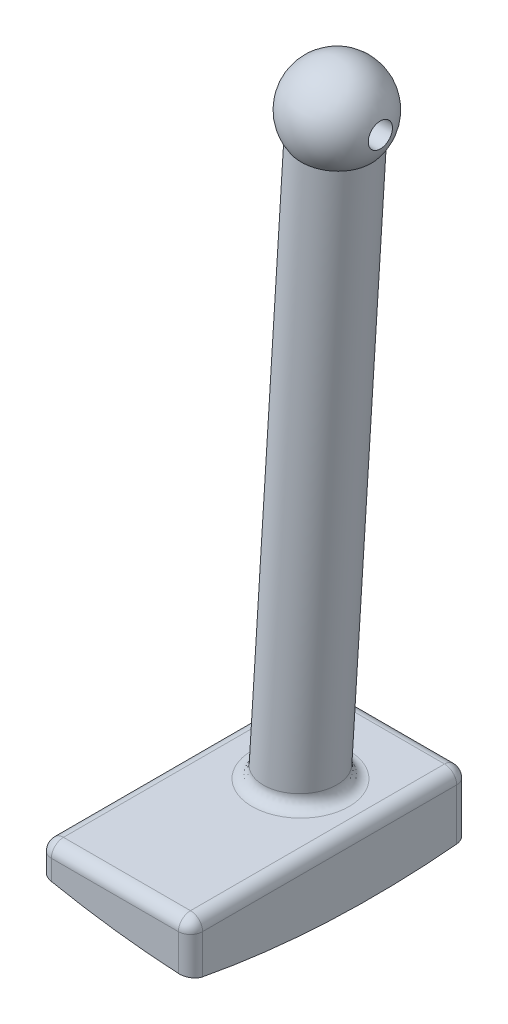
ISO-10303-21;
HEADER;
FILE_DESCRIPTION(('STEP AP214'),'2;1');
FILE_NAME('part.step','',(''),(''),'','','');
FILE_SCHEMA(('AUTOMOTIVE_DESIGN { 1 0 10303 214 1 1 1 1 }'));
ENDSEC;
DATA;
#1=APPLICATION_CONTEXT('core data for automotive mechanical design processes');
#2=APPLICATION_PROTOCOL_DEFINITION('international standard','automotive_design',2000,#1);
#3=PRODUCT_CONTEXT('',#1,'mechanical');
#4=PRODUCT('Part','Part','',(#3));
#5=PRODUCT_RELATED_PRODUCT_CATEGORY('part','',(#4));
#6=PRODUCT_DEFINITION_FORMATION('','',#4);
#7=PRODUCT_DEFINITION_CONTEXT('part definition',#1,'design');
#8=PRODUCT_DEFINITION('design','',#6,#7);
#9=PRODUCT_DEFINITION_SHAPE('','',#8);
#10=(LENGTH_UNIT() NAMED_UNIT(*) SI_UNIT(.MILLI.,.METRE.));
#11=(NAMED_UNIT(*) PLANE_ANGLE_UNIT() SI_UNIT($,.RADIAN.));
#12=(NAMED_UNIT(*) SI_UNIT($,.STERADIAN.) SOLID_ANGLE_UNIT());
#13=UNCERTAINTY_MEASURE_WITH_UNIT(LENGTH_MEASURE(1.E-05),#10,'distance_accuracy_value','');
#14=(GEOMETRIC_REPRESENTATION_CONTEXT(3) GLOBAL_UNCERTAINTY_ASSIGNED_CONTEXT((#13)) GLOBAL_UNIT_ASSIGNED_CONTEXT((#10,
#11,#12)) REPRESENTATION_CONTEXT('',''));
#15=CARTESIAN_POINT('',(0.,0.,0.));
#16=DIRECTION('',(0.,0.,1.));
#17=DIRECTION('',(1.,0.,0.));
#18=AXIS2_PLACEMENT_3D('',#15,#16,#17);
#19=CARTESIAN_POINT('',(-7.49527454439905,-25.4,0.));
#20=DIRECTION('',(-0.0620045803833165,-0.998075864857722,0.));
#21=DIRECTION('',(-0.998075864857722,0.0620045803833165,0.));
#22=AXIS2_PLACEMENT_3D('',#19,#20,#21);
#23=SPHERICAL_SURFACE('',#22,4.74114179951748);
#24=CARTESIAN_POINT('',(-2.92739477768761,-25.4,0.));
#25=DIRECTION('',(-1.,0.,0.));
#26=DIRECTION('',(0.,0.,1.));
#27=AXIS2_PLACEMENT_3D('',#24,#25,#26);
#28=CIRCLE('',#27,1.27);
#29=CARTESIAN_POINT('',(-2.92739477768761,-25.4,1.27));
#30=VERTEX_POINT('',#29);
#31=EDGE_CURVE('E289',#30,#30,#28,.F.);
#32=ORIENTED_EDGE('',*,*,#31,.F.);
#33=EDGE_LOOP('',(#32));
#34=FACE_BOUND('',#33,.T.);
#35=CARTESIAN_POINT('',(-7.67023654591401,-28.2163298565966,0.));
#36=DIRECTION('',(-0.0620045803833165,-0.998075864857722,0.));
#37=DIRECTION('',(0.998075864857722,-0.0620045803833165,0.));
#38=AXIS2_PLACEMENT_3D('',#35,#36,#37);
#39=CIRCLE('',#38,3.81);
#40=CARTESIAN_POINT('',(-3.86756750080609,-28.4525673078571,0.));
#41=VERTEX_POINT('',#40);
#42=EDGE_CURVE('E228',#41,#41,#39,.T.);
#43=ORIENTED_EDGE('',*,*,#42,.F.);
#44=EDGE_LOOP('',(#43));
#45=FACE_BOUND('',#44,.T.);
#46=CARTESIAN_POINT('',(-12.0631543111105,-25.4,0.));
#47=DIRECTION('',(1.,0.,0.));
#48=DIRECTION('',(0.,0.,-1.));
#49=AXIS2_PLACEMENT_3D('',#46,#47,#48);
#50=CIRCLE('',#49,1.27);
#51=CARTESIAN_POINT('',(-12.0631543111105,-25.4,-1.27));
#52=VERTEX_POINT('',#51);
#53=EDGE_CURVE('E36',#52,#52,#50,.F.);
#54=ORIENTED_EDGE('',*,*,#53,.F.);
#55=EDGE_LOOP('',(#54));
#56=FACE_BOUND('',#55,.T.);
#57=ADVANCED_FACE('F31',(#34,#45,#56),#23,.T.);
#58=CARTESIAN_POINT('',(68.8747113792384,-88.1136868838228,-100.115350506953));
#59=DIRECTION('',(0.,1.,0.));
#60=DIRECTION('',(0.,0.,1.));
#61=AXIS2_PLACEMENT_3D('',#58,#59,#60);
#62=PLANE('',#61);
#63=CARTESIAN_POINT('',(-11.312409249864,-88.1136868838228,0.));
#64=DIRECTION('',(0.,1.,0.));
#65=DIRECTION('',(-1.,0.,0.));
#66=AXIS2_PLACEMENT_3D('',#63,#64,#65);
#67=ELLIPSE('',#66,5.08979345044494,5.08);
#68=CARTESIAN_POINT('',(-16.4022027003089,-88.1136868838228,0.));
#69=VERTEX_POINT('',#68);
#70=EDGE_CURVE('E41',#69,#69,#67,.F.);
#71=ORIENTED_EDGE('',*,*,#70,.T.);
#72=EDGE_LOOP('',(#71));
#73=FACE_BOUND('',#72,.T.);
#74=DIRECTION('',(0.,0.,-1.));
#75=VECTOR('',#74,1.);
#76=CARTESIAN_POINT('',(-5.07999999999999,-88.1136868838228,-10.16));
#77=LINE('',#76,#75);
#78=CARTESIAN_POINT('',(-5.07999999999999,-88.1136868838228,17.78));
#79=VERTEX_POINT('',#78);
#80=CARTESIAN_POINT('',(-5.07999999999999,-88.1136868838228,-8.89));
#81=VERTEX_POINT('',#80);
#82=EDGE_CURVE('E263',#79,#81,#77,.T.);
#83=ORIENTED_EDGE('',*,*,#82,.T.);
#84=DIRECTION('',(1.,0.,0.));
#85=VECTOR('',#84,1.);
#86=CARTESIAN_POINT('',(-19.685,-88.1136868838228,-8.89));
#87=LINE('',#86,#85);
#88=CARTESIAN_POINT('',(-18.415,-88.1136868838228,-8.89));
#89=VERTEX_POINT('',#88);
#90=EDGE_CURVE('E57',#81,#89,#87,.F.);
#91=ORIENTED_EDGE('',*,*,#90,.T.);
#92=DIRECTION('',(0.,0.,1.));
#93=VECTOR('',#92,1.);
#94=CARTESIAN_POINT('',(-18.415,-88.1136868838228,19.05));
#95=LINE('',#94,#93);
#96=CARTESIAN_POINT('',(-18.415,-88.1136868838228,17.78));
#97=VERTEX_POINT('',#96);
#98=EDGE_CURVE('E284',#89,#97,#95,.T.);
#99=ORIENTED_EDGE('',*,*,#98,.T.);
#100=DIRECTION('',(1.,0.,0.));
#101=VECTOR('',#100,1.);
#102=CARTESIAN_POINT('',(68.8747113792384,-88.1136868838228,17.78));
#103=LINE('',#102,#101);
#104=EDGE_CURVE('E270',#97,#79,#103,.T.);
#105=ORIENTED_EDGE('',*,*,#104,.T.);
#106=EDGE_LOOP('',(#83,#91,#99,#105));
#107=FACE_BOUND('',#106,.T.);
#108=ADVANCED_FACE('F191',(#73,#107),#62,.T.);
#109=CARTESIAN_POINT('',(0.,0.,0.));
#110=DIRECTION('',(1.,0.,0.));
#111=DIRECTION('',(0.,-1.,0.));
#112=AXIS2_PLACEMENT_3D('',#109,#110,#111);
#113=SPHERICAL_SURFACE('',#112,95.25);
#114=CARTESIAN_POINT('',(0.,0.,-10.16));
#115=DIRECTION('',(0.,0.,1.));
#116=DIRECTION('',(1.,0.,0.));
#117=AXIS2_PLACEMENT_3D('',#114,#115,#116);
#118=CIRCLE('',#117,94.706583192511);
#119=CARTESIAN_POINT('',(-18.415,-92.8990025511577,-10.16));
#120=VERTEX_POINT('',#119);
#121=CARTESIAN_POINT('',(-5.07999999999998,-94.5702410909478,-10.16));
#122=VERTEX_POINT('',#121);
#123=EDGE_CURVE('E136',#120,#122,#118,.T.);
#124=ORIENTED_EDGE('',*,*,#123,.T.);
#125=CARTESIAN_POINT('',(-5.07999999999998,-94.5702410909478,-10.16));
#126=CARTESIAN_POINT('',(-5.04421423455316,-94.5721633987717,-10.1599998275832));
#127=CARTESIAN_POINT('',(-5.00845356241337,-94.5742265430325,-10.1584865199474));
#128=CARTESIAN_POINT('',(-4.93720604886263,-94.5786205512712,-10.1524536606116));
#129=CARTESIAN_POINT('',(-4.9017191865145,-94.5809513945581,-10.1479343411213));
#130=CARTESIAN_POINT('',(-4.79612750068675,-94.5883158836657,-10.129919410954));
#131=CARTESIAN_POINT('',(-4.72675683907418,-94.5937287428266,-10.1119666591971));
#132=CARTESIAN_POINT('',(-4.59208749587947,-94.6054014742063,-10.0647096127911));
#133=CARTESIAN_POINT('',(-4.52679020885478,-94.6116616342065,-10.0354014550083));
#134=CARTESIAN_POINT('',(-4.40208109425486,-94.6248504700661,-9.96629207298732));
#135=CARTESIAN_POINT('',(-4.34266867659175,-94.631779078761,-9.92649190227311));
#136=CARTESIAN_POINT('',(-4.2311590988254,-94.6461375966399,-9.83735732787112));
#137=CARTESIAN_POINT('',(-4.17909261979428,-94.6535694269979,-9.78798486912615));
#138=CARTESIAN_POINT('',(-4.08400312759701,-94.6687007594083,-9.68120258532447));
#139=CARTESIAN_POINT('',(-4.04098208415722,-94.6764003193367,-9.6237910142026));
#140=CARTESIAN_POINT('',(-3.9650431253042,-94.6918804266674,-9.50231177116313));
#141=CARTESIAN_POINT('',(-3.93216829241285,-94.6996611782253,-9.43821722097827));
#142=CARTESIAN_POINT('',(-3.87771536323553,-94.7150495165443,-9.30539741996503));
#143=CARTESIAN_POINT('',(-3.85613022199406,-94.7226572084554,-9.23667508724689));
#144=CARTESIAN_POINT('',(-3.8303660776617,-94.7348698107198,-9.12126241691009));
#145=CARTESIAN_POINT('',(-3.82273511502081,-94.7395896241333,-9.07532565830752));
#146=CARTESIAN_POINT('',(-3.81255303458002,-94.7488045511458,-8.98293693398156));
#147=CARTESIAN_POINT('',(-3.80999475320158,-94.7532999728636,-8.93648578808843));
#148=CARTESIAN_POINT('',(-3.80999999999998,-94.7576609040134,-8.89));
#149=B_SPLINE_CURVE_WITH_KNOTS('',3,(#125,#126,#127,#128,#129,#130,#131,#132,#133,#134,#135,
#136,#137,#138,#139,#140,#141,#142,#143,#144,#145,#146,#147,#148),.UNSPECIFIED.,.F.,.F.,(4,2,2,
2,2,2,2,2,2,2,2,4),(0.,0.107445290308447,0.214882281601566,0.429356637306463,0.643904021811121,
0.858429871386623,1.07382674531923,1.28927047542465,1.50561681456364,1.72182798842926,
1.86198316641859,2.00194027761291),.UNSPECIFIED.);
#150=CARTESIAN_POINT('',(-3.80999999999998,-94.7576609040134,-8.89));
#151=VERTEX_POINT('',#150);
#152=EDGE_CURVE('E134',#122,#151,#149,.T.);
#153=ORIENTED_EDGE('',*,*,#152,.T.);
#154=CARTESIAN_POINT('',(-3.80999999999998,0.,0.));
#155=DIRECTION('',(1.,0.,0.));
#156=DIRECTION('',(0.,0.,-1.));
#157=AXIS2_PLACEMENT_3D('',#154,#155,#156);
#158=CIRCLE('',#157,95.1737694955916);
#159=CARTESIAN_POINT('',(-3.80999999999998,-93.4982245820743,17.78));
#160=VERTEX_POINT('',#159);
#161=EDGE_CURVE('E118',#160,#151,#158,.T.);
#162=ORIENTED_EDGE('',*,*,#161,.F.);
#163=CARTESIAN_POINT('',(-3.80999999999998,-93.4982245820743,17.78));
#164=CARTESIAN_POINT('',(-3.81000055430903,-93.4912971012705,17.8164288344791));
#165=CARTESIAN_POINT('',(-3.81156831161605,-93.4842901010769,17.852823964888));
#166=CARTESIAN_POINT('',(-3.81781660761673,-93.4701610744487,17.9253211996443));
#167=CARTESIAN_POINT('',(-3.82249695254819,-93.4630390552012,17.9614233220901));
#168=CARTESIAN_POINT('',(-3.84115673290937,-93.4415858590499,18.0688549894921));
#169=CARTESIAN_POINT('',(-3.85975505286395,-93.4271472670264,18.1394164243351));
#170=CARTESIAN_POINT('',(-3.90874485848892,-93.3984204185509,18.2763448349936));
#171=CARTESIAN_POINT('',(-3.93914126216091,-93.3841322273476,18.3427100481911));
#172=CARTESIAN_POINT('',(-4.01089451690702,-93.3561126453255,18.4693515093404));
#173=CARTESIAN_POINT('',(-4.05224916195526,-93.3423811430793,18.5296289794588));
#174=CARTESIAN_POINT('',(-4.14471115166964,-93.3158977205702,18.6422256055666));
#175=CARTESIAN_POINT('',(-4.19580015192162,-93.3031440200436,18.6945594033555));
#176=CARTESIAN_POINT('',(-4.30639517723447,-93.2789640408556,18.7898323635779));
#177=CARTESIAN_POINT('',(-4.3659028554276,-93.267538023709,18.8327696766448));
#178=CARTESIAN_POINT('',(-4.49081360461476,-93.2465088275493,18.9073800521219));
#179=CARTESIAN_POINT('',(-4.55612988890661,-93.2368838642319,18.9391924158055));
#180=CARTESIAN_POINT('',(-4.69142590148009,-93.2195815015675,18.9912601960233));
#181=CARTESIAN_POINT('',(-4.76140092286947,-93.2119021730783,19.011527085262));
#182=CARTESIAN_POINT('',(-4.87331321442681,-93.2015619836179,19.0337569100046));
#183=CARTESIAN_POINT('',(-4.91440616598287,-93.1981612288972,19.0398421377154));
#184=CARTESIAN_POINT('',(-4.99698536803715,-93.1921107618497,19.0479620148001));
#185=CARTESIAN_POINT('',(-5.03847097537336,-93.1894599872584,19.0500024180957));
#186=CARTESIAN_POINT('',(-5.07999999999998,-93.1871965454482,19.05));
#187=B_SPLINE_CURVE_WITH_KNOTS('',3,(#163,#164,#165,#166,#167,#168,#169,#170,#171,#172,#173,
#174,#175,#176,#177,#178,#179,#180,#181,#182,#183,#184,#185,#186),.UNSPECIFIED.,.F.,.F.,(4,2,2,
2,2,2,2,2,2,2,2,4),(0.,0.111175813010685,0.222344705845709,0.444361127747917,0.666470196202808,
0.888534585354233,1.11018456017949,1.33187811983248,1.55068698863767,1.76927804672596,
1.89413289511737,2.01881000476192),.UNSPECIFIED.);
#188=CARTESIAN_POINT('',(-5.07999999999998,-93.1871965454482,19.05));
#189=VERTEX_POINT('',#188);
#190=EDGE_CURVE('E131',#160,#189,#187,.T.);
#191=ORIENTED_EDGE('',*,*,#190,.T.);
#192=CARTESIAN_POINT('',(0.,0.,19.05));
#193=DIRECTION('',(0.,0.,1.));
#194=DIRECTION('',(1.,0.,0.));
#195=AXIS2_PLACEMENT_3D('',#192,#193,#194);
#196=CIRCLE('',#195,93.3255592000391);
#197=CARTESIAN_POINT('',(-18.415,-91.4906977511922,19.05));
#198=VERTEX_POINT('',#197);
#199=EDGE_CURVE('E231',#198,#189,#196,.T.);
#200=ORIENTED_EDGE('',*,*,#199,.F.);
#201=CARTESIAN_POINT('',(-18.415,-91.4906977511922,19.05));
#202=CARTESIAN_POINT('',(-18.4498169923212,-91.4836899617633,19.0499995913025));
#203=CARTESIAN_POINT('',(-18.4846730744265,-91.4769517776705,19.0485672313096));
#204=CARTESIAN_POINT('',(-18.5542600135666,-91.4640585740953,19.0428250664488));
#205=CARTESIAN_POINT('',(-18.588990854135,-91.4579036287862,19.038514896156));
#206=CARTESIAN_POINT('',(-18.6926372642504,-91.4403888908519,19.0212545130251));
#207=CARTESIAN_POINT('',(-18.7610472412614,-91.4299710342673,19.0039744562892));
#208=CARTESIAN_POINT('',(-18.8944551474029,-91.4120130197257,18.9581383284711));
#209=CARTESIAN_POINT('',(-18.9594484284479,-91.4044766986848,18.9295673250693));
#210=CARTESIAN_POINT('',(-19.0839600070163,-91.3925625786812,18.8618537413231));
#211=CARTESIAN_POINT('',(-19.143481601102,-91.38818286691,18.8227175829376));
#212=CARTESIAN_POINT('',(-19.2540511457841,-91.3827947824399,18.7358927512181));
#213=CARTESIAN_POINT('',(-19.305251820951,-91.3817169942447,18.6884026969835));
#214=CARTESIAN_POINT('',(-19.3991757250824,-91.3827739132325,18.5856922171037));
#215=CARTESIAN_POINT('',(-19.4418983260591,-91.3849088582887,18.5304712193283));
#216=CARTESIAN_POINT('',(-19.5172306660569,-91.3922732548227,18.4145956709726));
#217=CARTESIAN_POINT('',(-19.5499481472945,-91.3974678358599,18.3540087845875));
#218=CARTESIAN_POINT('',(-19.605099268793,-91.4107488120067,18.2286126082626));
#219=CARTESIAN_POINT('',(-19.6275332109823,-91.4188351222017,18.1638034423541));
#220=CARTESIAN_POINT('',(-19.6580605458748,-91.4356526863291,18.0457066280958));
#221=CARTESIAN_POINT('',(-19.6681766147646,-91.4438914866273,17.9928591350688));
#222=CARTESIAN_POINT('',(-19.6816496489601,-91.4618306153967,17.8866335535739));
#223=CARTESIAN_POINT('',(-19.6850164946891,-91.4715287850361,17.8332563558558));
#224=CARTESIAN_POINT('',(-19.685,-91.4818827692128,17.78));
#225=B_SPLINE_CURVE_WITH_KNOTS('',3,(#201,#202,#203,#204,#205,#206,#207,#208,#209,#210,#211,
#212,#213,#214,#215,#216,#217,#218,#219,#220,#221,#222,#223,#224),.UNSPECIFIED.,.F.,.F.,(4,2,2,
2,2,2,2,2,2,2,2,4),(0.,0.106484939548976,0.212983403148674,0.425857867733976,0.639014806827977,
0.852042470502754,1.0605598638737,1.26909269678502,1.47529366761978,1.68148858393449,
1.84436169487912,2.0069961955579),.UNSPECIFIED.);
#226=CARTESIAN_POINT('',(-19.685,-91.4818827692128,17.78));
#227=VERTEX_POINT('',#226);
#228=EDGE_CURVE('E141',#198,#227,#225,.T.);
#229=ORIENTED_EDGE('',*,*,#228,.T.);
#230=CARTESIAN_POINT('',(-19.685,0.,0.));
#231=DIRECTION('',(1.,0.,0.));
#232=DIRECTION('',(0.,0.,-1.));
#233=AXIS2_PLACEMENT_3D('',#230,#231,#232);
#234=CIRCLE('',#233,93.1936868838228);
#235=CARTESIAN_POINT('',(-19.685,-92.7686971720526,-8.89));
#236=VERTEX_POINT('',#235);
#237=EDGE_CURVE('E135',#227,#236,#234,.T.);
#238=ORIENTED_EDGE('',*,*,#237,.T.);
#239=CARTESIAN_POINT('',(-19.685,-92.7686971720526,-8.89));
#240=CARTESIAN_POINT('',(-19.6849999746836,-92.7653553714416,-8.92487229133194));
#241=CARTESIAN_POINT('',(-19.6835627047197,-92.7622976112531,-8.95975590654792));
#242=CARTESIAN_POINT('',(-19.6778167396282,-92.7567701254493,-9.02933285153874));
#243=CARTESIAN_POINT('',(-19.6735080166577,-92.7543004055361,-9.06402617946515));
#244=CARTESIAN_POINT('',(-19.6562973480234,-92.7478101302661,-9.16739195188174));
#245=CARTESIAN_POINT('',(-19.6391108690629,-92.7446978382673,-9.2354610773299));
#246=CARTESIAN_POINT('',(-19.5937301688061,-92.7410116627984,-9.36791912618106));
#247=CARTESIAN_POINT('',(-19.5655276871,-92.7404396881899,-9.43230524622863));
#248=CARTESIAN_POINT('',(-19.4989194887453,-92.7418543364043,-9.55552165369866));
#249=CARTESIAN_POINT('',(-19.4605163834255,-92.7438403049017,-9.61435335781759));
#250=CARTESIAN_POINT('',(-19.3747957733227,-92.7502932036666,-9.72459603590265));
#251=CARTESIAN_POINT('',(-19.3275124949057,-92.7547507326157,-9.77603420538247));
#252=CARTESIAN_POINT('',(-19.2253119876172,-92.7659985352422,-9.87037298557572));
#253=CARTESIAN_POINT('',(-19.1703935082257,-92.772789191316,-9.91327219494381));
#254=CARTESIAN_POINT('',(-19.0539907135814,-92.7885632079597,-9.98976644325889));
#255=CARTESIAN_POINT('',(-18.9924515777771,-92.7975658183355,-10.0232739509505));
#256=CARTESIAN_POINT('',(-18.8649662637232,-92.8174606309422,-10.0796579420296));
#257=CARTESIAN_POINT('',(-18.7990205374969,-92.8283526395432,-10.1025355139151));
#258=CARTESIAN_POINT('',(-18.6799417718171,-92.8490346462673,-10.1332123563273));
#259=CARTESIAN_POINT('',(-18.6273195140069,-92.8585088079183,-10.1432612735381));
#260=CARTESIAN_POINT('',(-18.5214478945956,-92.87821993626,-10.1566568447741));
#261=CARTESIAN_POINT('',(-18.4681995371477,-92.8884557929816,-10.1600130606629));
#262=CARTESIAN_POINT('',(-18.415,-92.8990025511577,-10.16));
#263=B_SPLINE_CURVE_WITH_KNOTS('',3,(#239,#240,#241,#242,#243,#244,#245,#246,#247,#248,#249,
#250,#251,#252,#253,#254,#255,#256,#257,#258,#259,#260,#261,#262),.UNSPECIFIED.,.F.,.F.,(4,2,2,
2,2,2,2,2,2,2,2,4),(0.,0.10503350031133,0.210068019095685,0.419807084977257,0.629703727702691,
0.839546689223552,1.04859687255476,1.25768133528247,1.46865417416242,1.67960540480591,
1.84241149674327,2.00498482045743),.UNSPECIFIED.);
#264=EDGE_CURVE('E144',#236,#120,#263,.T.);
#265=ORIENTED_EDGE('',*,*,#264,.T.);
#266=EDGE_LOOP('',(#124,#153,#162,#191,#200,#229,#238,#265));
#267=FACE_BOUND('',#266,.T.);
#268=ADVANCED_FACE('F33',(#267),#113,.T.);
#269=CARTESIAN_POINT('',(-19.685,-88.1136868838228,0.));
#270=DIRECTION('',(1.,0.,0.));
#271=DIRECTION('',(0.,0.,-1.));
#272=AXIS2_PLACEMENT_3D('',#269,#270,#271);
#273=PLANE('',#272);
#274=DIRECTION('',(0.,0.,1.));
#275=VECTOR('',#274,1.);
#276=CARTESIAN_POINT('',(-19.685,-89.3836868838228,-10.16));
#277=LINE('',#276,#275);
#278=CARTESIAN_POINT('',(-19.685,-89.3836868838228,17.78));
#279=VERTEX_POINT('',#278);
#280=CARTESIAN_POINT('',(-19.685,-89.3836868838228,-8.89));
#281=VERTEX_POINT('',#280);
#282=EDGE_CURVE('E315',#279,#281,#277,.F.);
#283=ORIENTED_EDGE('',*,*,#282,.T.);
#284=DIRECTION('',(0.,-1.,0.));
#285=VECTOR('',#284,1.);
#286=CARTESIAN_POINT('',(-19.685,-88.1136868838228,-8.89));
#287=LINE('',#286,#285);
#288=EDGE_CURVE('E250',#281,#236,#287,.T.);
#289=ORIENTED_EDGE('',*,*,#288,.T.);
#290=ORIENTED_EDGE('',*,*,#237,.F.);
#291=DIRECTION('',(0.,-1.,0.));
#292=VECTOR('',#291,1.);
#293=CARTESIAN_POINT('',(-19.685,-88.1136868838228,17.78));
#294=LINE('',#293,#292);
#295=EDGE_CURVE('E278',#227,#279,#294,.F.);
#296=ORIENTED_EDGE('',*,*,#295,.T.);
#297=EDGE_LOOP('',(#283,#289,#290,#296));
#298=FACE_BOUND('',#297,.T.);
#299=ADVANCED_FACE('F309',(#298),#273,.F.);
#300=CARTESIAN_POINT('',(-3.80999999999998,-95.1737694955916,0.));
#301=DIRECTION('',(-1.,0.,0.));
#302=DIRECTION('',(0.,0.,1.));
#303=AXIS2_PLACEMENT_3D('',#300,#301,#302);
#304=PLANE('',#303);
#305=ORIENTED_EDGE('',*,*,#161,.T.);
#306=DIRECTION('',(0.,1.,0.));
#307=VECTOR('',#306,1.);
#308=CARTESIAN_POINT('',(-3.80999999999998,-95.1737694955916,-8.89));
#309=LINE('',#308,#307);
#310=CARTESIAN_POINT('',(-3.80999999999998,-89.3836868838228,-8.89));
#311=VERTEX_POINT('',#310);
#312=EDGE_CURVE('E126',#151,#311,#309,.T.);
#313=ORIENTED_EDGE('',*,*,#312,.T.);
#314=DIRECTION('',(0.,0.,-1.));
#315=VECTOR('',#314,1.);
#316=CARTESIAN_POINT('',(-3.80999999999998,-89.3836868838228,19.05));
#317=LINE('',#316,#315);
#318=CARTESIAN_POINT('',(-3.80999999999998,-89.3836868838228,17.78));
#319=VERTEX_POINT('',#318);
#320=EDGE_CURVE('E121',#311,#319,#317,.F.);
#321=ORIENTED_EDGE('',*,*,#320,.T.);
#322=DIRECTION('',(0.,1.,0.));
#323=VECTOR('',#322,1.);
#324=CARTESIAN_POINT('',(-3.80999999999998,-93.2477554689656,17.78));
#325=LINE('',#324,#323);
#326=EDGE_CURVE('E114',#319,#160,#325,.F.);
#327=ORIENTED_EDGE('',*,*,#326,.T.);
#328=EDGE_LOOP('',(#305,#313,#321,#327));
#329=FACE_BOUND('',#328,.T.);
#330=ADVANCED_FACE('F116',(#329),#304,.F.);
#331=CARTESIAN_POINT('',(-27.2826872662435,-100.195539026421,-10.16));
#332=DIRECTION('',(0.,0.,1.));
#333=DIRECTION('',(1.,0.,0.));
#334=AXIS2_PLACEMENT_3D('',#331,#332,#333);
#335=PLANE('',#334);
#336=DIRECTION('',(1.,0.,0.));
#337=VECTOR('',#336,1.);
#338=CARTESIAN_POINT('',(-3.80999999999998,-89.3836868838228,-10.16));
#339=LINE('',#338,#337);
#340=CARTESIAN_POINT('',(-18.415,-89.3836868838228,-10.16));
#341=VERTEX_POINT('',#340);
#342=CARTESIAN_POINT('',(-5.07999999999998,-89.3836868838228,-10.16));
#343=VERTEX_POINT('',#342);
#344=EDGE_CURVE('E238',#341,#343,#339,.T.);
#345=ORIENTED_EDGE('',*,*,#344,.T.);
#346=DIRECTION('',(0.,1.,0.));
#347=VECTOR('',#346,1.);
#348=CARTESIAN_POINT('',(-5.07999999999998,-100.195539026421,-10.16));
#349=LINE('',#348,#347);
#350=EDGE_CURVE('E142',#343,#122,#349,.F.);
#351=ORIENTED_EDGE('',*,*,#350,.T.);
#352=ORIENTED_EDGE('',*,*,#123,.F.);
#353=DIRECTION('',(0.,-1.,0.));
#354=VECTOR('',#353,1.);
#355=CARTESIAN_POINT('',(-18.415,-100.195539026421,-10.16));
#356=LINE('',#355,#354);
#357=EDGE_CURVE('E146',#120,#341,#356,.F.);
#358=ORIENTED_EDGE('',*,*,#357,.T.);
#359=EDGE_LOOP('',(#345,#351,#352,#358));
#360=FACE_BOUND('',#359,.T.);
#361=ADVANCED_FACE('F243',(#360),#335,.F.);
#362=CARTESIAN_POINT('',(-33.4591405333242,-99.8983781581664,19.05));
#363=DIRECTION('',(0.,0.,1.));
#364=DIRECTION('',(1.,0.,0.));
#365=AXIS2_PLACEMENT_3D('',#362,#363,#364);
#366=PLANE('',#365);
#367=DIRECTION('',(1.,0.,0.));
#368=VECTOR('',#367,1.);
#369=CARTESIAN_POINT('',(-33.4591405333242,-89.3836868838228,19.05));
#370=LINE('',#369,#368);
#371=CARTESIAN_POINT('',(-5.07999999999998,-89.3836868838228,19.05));
#372=VERTEX_POINT('',#371);
#373=CARTESIAN_POINT('',(-18.415,-89.3836868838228,19.05));
#374=VERTEX_POINT('',#373);
#375=EDGE_CURVE('E271',#372,#374,#370,.F.);
#376=ORIENTED_EDGE('',*,*,#375,.T.);
#377=DIRECTION('',(0.,-1.,0.));
#378=VECTOR('',#377,1.);
#379=CARTESIAN_POINT('',(-18.415,-91.2258777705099,19.05));
#380=LINE('',#379,#378);
#381=EDGE_CURVE('E276',#374,#198,#380,.T.);
#382=ORIENTED_EDGE('',*,*,#381,.T.);
#383=ORIENTED_EDGE('',*,*,#199,.T.);
#384=DIRECTION('',(0.,1.,0.));
#385=VECTOR('',#384,1.);
#386=CARTESIAN_POINT('',(-5.07999999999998,-88.1136868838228,19.05));
#387=LINE('',#386,#385);
#388=EDGE_CURVE('E140',#189,#372,#387,.T.);
#389=ORIENTED_EDGE('',*,*,#388,.T.);
#390=EDGE_LOOP('',(#376,#382,#383,#389));
#391=FACE_BOUND('',#390,.T.);
#392=ADVANCED_FACE('F176',(#391),#366,.T.);
#393=CARTESIAN_POINT('',(-11.7891449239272,-94.5176097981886,0.));
#394=DIRECTION('',(-0.0620045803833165,-0.998075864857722,0.));
#395=DIRECTION('',(0.998075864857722,-0.0620045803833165,0.));
#396=AXIS2_PLACEMENT_3D('',#393,#394,#395);
#397=CYLINDRICAL_SURFACE('',#396,3.81);
#398=CARTESIAN_POINT('',(-11.312409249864,-86.8436868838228,0.));
#399=DIRECTION('',(0.0205976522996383,-0.999787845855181,0.));
#400=DIRECTION('',(-0.999787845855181,-0.0205976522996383,0.));
#401=AXIS2_PLACEMENT_3D('',#398,#399,#400);
#402=ELLIPSE('',#401,3.82304817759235,3.81);
#403=CARTESIAN_POINT('',(-15.1346463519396,-86.9224327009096,0.));
#404=VERTEX_POINT('',#403);
#405=EDGE_CURVE('E11',#404,#404,#402,.F.);
#406=ORIENTED_EDGE('',*,*,#405,.T.);
#407=EDGE_LOOP('',(#406));
#408=FACE_BOUND('',#407,.T.);
#409=ORIENTED_EDGE('',*,*,#42,.T.);
#410=EDGE_LOOP('',(#409));
#411=FACE_BOUND('',#410,.T.);
#412=ADVANCED_FACE('F171',(#408,#411),#397,.T.);
#413=CARTESIAN_POINT('',(-18.415,-99.8983781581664,17.78));
#414=DIRECTION('',(0.,1.,0.));
#415=DIRECTION('',(0.,0.,1.));
#416=AXIS2_PLACEMENT_3D('',#413,#414,#415);
#417=CYLINDRICAL_SURFACE('',#416,1.27);
#418=CARTESIAN_POINT('',(-18.415,-89.3836868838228,17.78));
#419=DIRECTION('',(0.,1.,0.));
#420=DIRECTION('',(0.,0.,1.));
#421=AXIS2_PLACEMENT_3D('',#418,#419,#420);
#422=CIRCLE('',#421,1.27);
#423=EDGE_CURVE('E225',#279,#374,#422,.T.);
#424=ORIENTED_EDGE('',*,*,#423,.F.);
#425=ORIENTED_EDGE('',*,*,#295,.F.);
#426=ORIENTED_EDGE('',*,*,#228,.F.);
#427=ORIENTED_EDGE('',*,*,#381,.F.);
#428=EDGE_LOOP('',(#424,#425,#426,#427));
#429=FACE_BOUND('',#428,.T.);
#430=ADVANCED_FACE('F166',(#429),#417,.T.);
#431=CARTESIAN_POINT('',(-18.415,-89.3836868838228,17.78));
#432=DIRECTION('',(0.,0.,1.));
#433=DIRECTION('',(1.,0.,0.));
#434=AXIS2_PLACEMENT_3D('',#431,#432,#433);
#435=SPHERICAL_SURFACE('',#434,1.27);
#436=CARTESIAN_POINT('',(-18.415,-89.3836868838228,17.78));
#437=DIRECTION('',(0.,0.,1.));
#438=DIRECTION('',(1.,0.,0.));
#439=AXIS2_PLACEMENT_3D('',#436,#437,#438);
#440=CIRCLE('',#439,1.27);
#441=EDGE_CURVE('E219',#279,#97,#440,.F.);
#442=ORIENTED_EDGE('',*,*,#441,.F.);
#443=ORIENTED_EDGE('',*,*,#423,.T.);
#444=CARTESIAN_POINT('',(-18.415,-89.3836868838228,17.78));
#445=DIRECTION('',(-1.,0.,0.));
#446=DIRECTION('',(0.,0.,1.));
#447=AXIS2_PLACEMENT_3D('',#444,#445,#446);
#448=CIRCLE('',#447,1.27);
#449=EDGE_CURVE('E222',#97,#374,#448,.F.);
#450=ORIENTED_EDGE('',*,*,#449,.F.);
#451=EDGE_LOOP('',(#442,#443,#450));
#452=FACE_BOUND('',#451,.T.);
#453=ADVANCED_FACE('F163',(#452),#435,.T.);
#454=CARTESIAN_POINT('',(-5.07999999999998,-99.8983781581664,17.78));
#455=DIRECTION('',(0.,-1.,0.));
#456=DIRECTION('',(0.,0.,-1.));
#457=AXIS2_PLACEMENT_3D('',#454,#455,#456);
#458=CYLINDRICAL_SURFACE('',#457,1.27);
#459=ORIENTED_EDGE('',*,*,#190,.F.);
#460=ORIENTED_EDGE('',*,*,#326,.F.);
#461=CARTESIAN_POINT('',(-5.07999999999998,-89.3836868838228,17.78));
#462=DIRECTION('',(0.,1.,0.));
#463=DIRECTION('',(0.,0.,1.));
#464=AXIS2_PLACEMENT_3D('',#461,#462,#463);
#465=CIRCLE('',#464,1.27);
#466=EDGE_CURVE('E217',#372,#319,#465,.T.);
#467=ORIENTED_EDGE('',*,*,#466,.F.);
#468=ORIENTED_EDGE('',*,*,#388,.F.);
#469=EDGE_LOOP('',(#459,#460,#467,#468));
#470=FACE_BOUND('',#469,.T.);
#471=ADVANCED_FACE('F139',(#470),#458,.T.);
#472=CARTESIAN_POINT('',(68.8747113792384,-89.3836868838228,17.78));
#473=DIRECTION('',(1.,0.,0.));
#474=DIRECTION('',(0.,0.,-1.));
#475=AXIS2_PLACEMENT_3D('',#472,#473,#474);
#476=CYLINDRICAL_SURFACE('',#475,1.27);
#477=ORIENTED_EDGE('',*,*,#449,.T.);
#478=ORIENTED_EDGE('',*,*,#375,.F.);
#479=CARTESIAN_POINT('',(-5.07999999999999,-89.3836868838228,17.78));
#480=DIRECTION('',(1.,0.,0.));
#481=DIRECTION('',(0.,0.,-1.));
#482=AXIS2_PLACEMENT_3D('',#479,#480,#481);
#483=CIRCLE('',#482,1.27);
#484=EDGE_CURVE('E214',#79,#372,#483,.T.);
#485=ORIENTED_EDGE('',*,*,#484,.F.);
#486=ORIENTED_EDGE('',*,*,#104,.F.);
#487=EDGE_LOOP('',(#477,#478,#485,#486));
#488=FACE_BOUND('',#487,.T.);
#489=ADVANCED_FACE('F162',(#488),#476,.T.);
#490=CARTESIAN_POINT('',(-18.415,-89.3836868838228,-100.115350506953));
#491=DIRECTION('',(0.,0.,-1.));
#492=DIRECTION('',(-1.,0.,0.));
#493=AXIS2_PLACEMENT_3D('',#490,#491,#492);
#494=CYLINDRICAL_SURFACE('',#493,1.27);
#495=ORIENTED_EDGE('',*,*,#441,.T.);
#496=ORIENTED_EDGE('',*,*,#98,.F.);
#497=CARTESIAN_POINT('',(-18.415,-89.3836868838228,-8.89));
#498=DIRECTION('',(0.,0.,-1.));
#499=DIRECTION('',(-1.,0.,0.));
#500=AXIS2_PLACEMENT_3D('',#497,#498,#499);
#501=CIRCLE('',#500,1.27);
#502=EDGE_CURVE('E211',#281,#89,#501,.T.);
#503=ORIENTED_EDGE('',*,*,#502,.F.);
#504=ORIENTED_EDGE('',*,*,#282,.F.);
#505=EDGE_LOOP('',(#495,#496,#503,#504));
#506=FACE_BOUND('',#505,.T.);
#507=ADVANCED_FACE('F314',(#506),#494,.T.);
#508=CARTESIAN_POINT('',(-18.415,-88.1136868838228,-8.89));
#509=DIRECTION('',(0.,-1.,0.));
#510=DIRECTION('',(0.,0.,-1.));
#511=AXIS2_PLACEMENT_3D('',#508,#509,#510);
#512=CYLINDRICAL_SURFACE('',#511,1.27);
#513=ORIENTED_EDGE('',*,*,#264,.F.);
#514=ORIENTED_EDGE('',*,*,#288,.F.);
#515=CARTESIAN_POINT('',(-18.415,-89.3836868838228,-8.89));
#516=DIRECTION('',(0.,1.,0.));
#517=DIRECTION('',(0.,0.,1.));
#518=AXIS2_PLACEMENT_3D('',#515,#516,#517);
#519=CIRCLE('',#518,1.27);
#520=EDGE_CURVE('E208',#341,#281,#519,.T.);
#521=ORIENTED_EDGE('',*,*,#520,.F.);
#522=ORIENTED_EDGE('',*,*,#357,.F.);
#523=EDGE_LOOP('',(#513,#514,#521,#522));
#524=FACE_BOUND('',#523,.T.);
#525=ADVANCED_FACE('F249',(#524),#512,.T.);
#526=CARTESIAN_POINT('',(-5.07999999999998,-89.3836868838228,17.78));
#527=DIRECTION('',(0.,0.,1.));
#528=DIRECTION('',(1.,0.,0.));
#529=AXIS2_PLACEMENT_3D('',#526,#527,#528);
#530=SPHERICAL_SURFACE('',#529,1.27);
#531=ORIENTED_EDGE('',*,*,#484,.T.);
#532=ORIENTED_EDGE('',*,*,#466,.T.);
#533=CARTESIAN_POINT('',(-5.07999999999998,-89.3836868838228,17.78));
#534=DIRECTION('',(0.,0.,1.));
#535=DIRECTION('',(0.,-1.,0.));
#536=AXIS2_PLACEMENT_3D('',#533,#534,#535);
#537=CIRCLE('',#536,1.27);
#538=EDGE_CURVE('E205',#79,#319,#537,.F.);
#539=ORIENTED_EDGE('',*,*,#538,.F.);
#540=EDGE_LOOP('',(#531,#532,#539));
#541=FACE_BOUND('',#540,.T.);
#542=ADVANCED_FACE('F265',(#541),#530,.T.);
#543=CARTESIAN_POINT('',(-18.415,-89.3836868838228,-8.89));
#544=DIRECTION('',(0.,0.,1.));
#545=DIRECTION('',(1.,0.,0.));
#546=AXIS2_PLACEMENT_3D('',#543,#544,#545);
#547=SPHERICAL_SURFACE('',#546,1.27);
#548=ORIENTED_EDGE('',*,*,#520,.T.);
#549=ORIENTED_EDGE('',*,*,#502,.T.);
#550=CARTESIAN_POINT('',(-18.415,-89.3836868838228,-8.89));
#551=DIRECTION('',(-1.,0.,0.));
#552=DIRECTION('',(0.,0.,1.));
#553=AXIS2_PLACEMENT_3D('',#550,#551,#552);
#554=CIRCLE('',#553,1.27);
#555=EDGE_CURVE('E202',#341,#89,#554,.F.);
#556=ORIENTED_EDGE('',*,*,#555,.F.);
#557=EDGE_LOOP('',(#548,#549,#556));
#558=FACE_BOUND('',#557,.T.);
#559=ADVANCED_FACE('F253',(#558),#547,.T.);
#560=CARTESIAN_POINT('',(-5.07999999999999,-89.3836868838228,-100.115350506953));
#561=DIRECTION('',(0.,0.,1.));
#562=DIRECTION('',(1.,0.,0.));
#563=AXIS2_PLACEMENT_3D('',#560,#561,#562);
#564=CYLINDRICAL_SURFACE('',#563,1.27);
#565=ORIENTED_EDGE('',*,*,#538,.T.);
#566=ORIENTED_EDGE('',*,*,#320,.F.);
#567=CARTESIAN_POINT('',(-5.07999999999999,-89.3836868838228,-8.89));
#568=DIRECTION('',(0.,0.,-1.));
#569=DIRECTION('',(-1.,0.,0.));
#570=AXIS2_PLACEMENT_3D('',#567,#568,#569);
#571=CIRCLE('',#570,1.27);
#572=EDGE_CURVE('E200',#81,#311,#571,.T.);
#573=ORIENTED_EDGE('',*,*,#572,.F.);
#574=ORIENTED_EDGE('',*,*,#82,.F.);
#575=EDGE_LOOP('',(#565,#566,#573,#574));
#576=FACE_BOUND('',#575,.T.);
#577=ADVANCED_FACE('F261',(#576),#564,.T.);
#578=CARTESIAN_POINT('',(-27.2826872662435,-89.3836868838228,-8.89));
#579=DIRECTION('',(-1.,0.,0.));
#580=DIRECTION('',(0.,0.,1.));
#581=AXIS2_PLACEMENT_3D('',#578,#579,#580);
#582=CYLINDRICAL_SURFACE('',#581,1.27);
#583=ORIENTED_EDGE('',*,*,#555,.T.);
#584=ORIENTED_EDGE('',*,*,#90,.F.);
#585=CARTESIAN_POINT('',(-5.07999999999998,-89.3836868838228,-8.89));
#586=DIRECTION('',(1.,0.,0.));
#587=DIRECTION('',(0.,1.,0.));
#588=AXIS2_PLACEMENT_3D('',#585,#586,#587);
#589=CIRCLE('',#588,1.27);
#590=EDGE_CURVE('E49',#343,#81,#589,.T.);
#591=ORIENTED_EDGE('',*,*,#590,.F.);
#592=ORIENTED_EDGE('',*,*,#344,.F.);
#593=EDGE_LOOP('',(#583,#584,#591,#592));
#594=FACE_BOUND('',#593,.T.);
#595=ADVANCED_FACE('F255',(#594),#582,.T.);
#596=CARTESIAN_POINT('',(-5.07999999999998,-89.3836868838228,-8.89));
#597=DIRECTION('',(0.,0.,1.));
#598=DIRECTION('',(1.,0.,0.));
#599=AXIS2_PLACEMENT_3D('',#596,#597,#598);
#600=SPHERICAL_SURFACE('',#599,1.27);
#601=ORIENTED_EDGE('',*,*,#590,.T.);
#602=ORIENTED_EDGE('',*,*,#572,.T.);
#603=CARTESIAN_POINT('',(-5.07999999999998,-89.3836868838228,-8.89));
#604=DIRECTION('',(0.,1.,0.));
#605=DIRECTION('',(0.,0.,1.));
#606=AXIS2_PLACEMENT_3D('',#603,#604,#605);
#607=CIRCLE('',#606,1.27);
#608=EDGE_CURVE('E197',#343,#311,#607,.F.);
#609=ORIENTED_EDGE('',*,*,#608,.F.);
#610=EDGE_LOOP('',(#601,#602,#609));
#611=FACE_BOUND('',#610,.T.);
#612=ADVANCED_FACE('F258',(#611),#600,.T.);
#613=CARTESIAN_POINT('',(-5.07999999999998,-95.1737694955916,-8.89));
#614=DIRECTION('',(0.,1.,0.));
#615=DIRECTION('',(0.,0.,1.));
#616=AXIS2_PLACEMENT_3D('',#613,#614,#615);
#617=CYLINDRICAL_SURFACE('',#616,1.27);
#618=ORIENTED_EDGE('',*,*,#152,.F.);
#619=ORIENTED_EDGE('',*,*,#350,.F.);
#620=ORIENTED_EDGE('',*,*,#608,.T.);
#621=ORIENTED_EDGE('',*,*,#312,.F.);
#622=EDGE_LOOP('',(#618,#619,#620,#621));
#623=FACE_BOUND('',#622,.T.);
#624=ADVANCED_FACE('F187',(#623),#617,.T.);
#625=CARTESIAN_POINT('',(-15.1346463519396,-86.9224327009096,0.));
#626=CARTESIAN_POINT('',(-15.2086519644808,-88.1136868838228,0.));
#627=CARTESIAN_POINT('',(-16.4022027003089,-88.1136868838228,0.));
#628=CARTESIAN_POINT('',(-15.1346463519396,-86.9224327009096,0.166244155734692));
#629=CARTESIAN_POINT('',(-15.2086519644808,-88.1136868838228,0.169479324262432));
#630=CARTESIAN_POINT('',(-16.4022027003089,-88.1136868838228,0.221658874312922));
#631=CARTESIAN_POINT('',(-15.1237147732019,-86.9222074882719,0.332488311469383));
#632=CARTESIAN_POINT('',(-15.1973040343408,-88.1136868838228,0.338986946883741));
#633=CARTESIAN_POINT('',(-16.3876459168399,-88.1136868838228,0.443317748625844));
#634=CARTESIAN_POINT('',(-15.0801769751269,-86.92131052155,0.66213201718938));
#635=CARTESIAN_POINT('',(-15.1521424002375,-88.1136868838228,0.674890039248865));
#636=CARTESIAN_POINT('',(-16.3296698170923,-88.1136868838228,0.882842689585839));
#637=CARTESIAN_POINT('',(-15.0475693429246,-86.920638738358,0.825531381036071));
#638=CARTESIAN_POINT('',(-15.1183122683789,-88.1136868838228,0.841339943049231));
#639=CARTESIAN_POINT('',(-16.2862486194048,-88.1136868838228,1.10070850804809));
#640=CARTESIAN_POINT('',(-14.9612387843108,-86.9188601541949,1.14668996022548));
#641=CARTESIAN_POINT('',(-15.028837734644,-88.1136868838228,1.1681377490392));
#642=CARTESIAN_POINT('',(-16.1712885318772,-88.1136868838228,1.52891994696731));
#643=CARTESIAN_POINT('',(-14.907513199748,-86.9177532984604,1.30444846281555));
#644=CARTESIAN_POINT('',(-14.9731616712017,-88.1136868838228,1.3285337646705));
#645=CARTESIAN_POINT('',(-16.0997461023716,-88.1136868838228,1.7392646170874));
#646=CARTESIAN_POINT('',(-14.7798671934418,-86.9151235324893,1.61162663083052));
#647=CARTESIAN_POINT('',(-14.8410530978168,-88.1136868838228,1.64035922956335));
#648=CARTESIAN_POINT('',(-15.9297692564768,-88.1136868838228,2.14883550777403));
#649=CARTESIAN_POINT('',(-14.7059431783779,-86.913600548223,1.76104480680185));
#650=CARTESIAN_POINT('',(-14.7645759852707,-88.1136868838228,1.79182680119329));
#651=CARTESIAN_POINT('',(-15.8313300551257,-88.1136868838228,2.34805974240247));
#652=CARTESIAN_POINT('',(-14.5391660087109,-86.9101646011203,2.04898656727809));
#653=CARTESIAN_POINT('',(-14.5923055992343,-88.1136868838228,2.0831124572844));
#654=CARTESIAN_POINT('',(-15.6092451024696,-88.1136868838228,2.73198208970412));
#655=CARTESIAN_POINT('',(-14.4463087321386,-86.9082515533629,2.18750777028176));
#656=CARTESIAN_POINT('',(-14.496457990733,-88.1136868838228,2.22295576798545));
#657=CARTESIAN_POINT('',(-15.4855938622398,-88.1136868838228,2.91667702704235));
#658=CARTESIAN_POINT('',(-14.2432542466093,-86.9040682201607,2.4512863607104));
#659=CARTESIAN_POINT('',(-14.2872373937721,-88.1136868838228,2.48854344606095));
#660=CARTESIAN_POINT('',(-15.2152010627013,-88.1136868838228,3.26838181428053));
#661=CARTESIAN_POINT('',(-14.1330528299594,-86.9017978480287,2.5765405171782));
#662=CARTESIAN_POINT('',(-14.1738042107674,-88.1136868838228,2.61429821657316));
#663=CARTESIAN_POINT('',(-15.0684539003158,-88.1136868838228,3.4353873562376));
#664=CARTESIAN_POINT('',(-13.8971955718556,-86.896938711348,2.81164270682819));
#665=CARTESIAN_POINT('',(-13.9315145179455,-88.1136868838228,2.84953889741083));
#666=CARTESIAN_POINT('',(-14.7543800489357,-88.1136868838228,3.74885694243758));
#667=CARTESIAN_POINT('',(-13.771535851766,-86.8943498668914,2.92148685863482));
#668=CARTESIAN_POINT('',(-13.8025961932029,-88.1136868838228,2.95901957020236));
#669=CARTESIAN_POINT('',(-14.5870481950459,-88.1136868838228,3.89531581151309));
#670=CARTESIAN_POINT('',(-13.506911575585,-86.8888980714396,3.12389015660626));
#671=CARTESIAN_POINT('',(-13.5317041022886,-88.1136868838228,3.15986094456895));
#672=CARTESIAN_POINT('',(-14.2346674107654,-88.1136868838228,4.16518687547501));
#673=CARTESIAN_POINT('',(-13.3679437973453,-86.8860350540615,3.21644510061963));
#674=CARTESIAN_POINT('',(-13.3896711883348,-88.1136868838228,3.25120110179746));
#675=CARTESIAN_POINT('',(-14.0496141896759,-88.1136868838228,4.28859346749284));
#676=CARTESIAN_POINT('',(-13.0790803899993,-86.8800838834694,3.38268655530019));
#677=CARTESIAN_POINT('',(-13.0951331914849,-88.1136868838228,3.41426071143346));
#678=CARTESIAN_POINT('',(-13.6649559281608,-88.1136868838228,4.51024874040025));
#679=CARTESIAN_POINT('',(-12.92918239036,-86.8769956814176,3.45636895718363));
#680=CARTESIAN_POINT('',(-12.9425756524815,-88.1136868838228,3.48594575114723));
#681=CARTESIAN_POINT('',(-13.4653477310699,-88.1136868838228,4.60849194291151));
#682=CARTESIAN_POINT('',(-12.6210223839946,-86.8706469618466,3.58360437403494));
#683=CARTESIAN_POINT('',(-12.6297329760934,-88.1136868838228,3.60856796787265));
#684=CARTESIAN_POINT('',(-13.0549936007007,-88.1136868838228,4.77813916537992));
#685=CARTESIAN_POINT('',(-12.4627588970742,-86.8673864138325,3.63715381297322));
#686=CARTESIAN_POINT('',(-12.469405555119,-88.1136868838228,3.65945927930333));
#687=CARTESIAN_POINT('',(-12.8442456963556,-88.1136868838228,4.84953841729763));
#688=CARTESIAN_POINT('',(-12.1405749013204,-86.8607487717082,3.72320638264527));
#689=CARTESIAN_POINT('',(-12.14387273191,-88.1136868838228,3.73975484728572));
#690=CARTESIAN_POINT('',(-12.4152168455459,-88.1136868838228,4.96427517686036));
#691=CARTESIAN_POINT('',(-11.9766536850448,-86.8573716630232,3.75570687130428));
#692=CARTESIAN_POINT('',(-11.9786379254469,-88.1136868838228,3.76910498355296));
#693=CARTESIAN_POINT('',(-12.1969349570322,-88.1136868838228,5.00760916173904));
#694=CARTESIAN_POINT('',(-11.6459581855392,-86.850558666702,3.79910438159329));
#695=CARTESIAN_POINT('',(-11.646188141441,-88.1136868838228,3.80597239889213));
#696=CARTESIAN_POINT('',(-11.7565719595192,-88.1136868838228,5.06547250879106));
#697=CARTESIAN_POINT('',(-11.4791837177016,-86.8471227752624,3.81));
#698=CARTESIAN_POINT('',(-11.4789584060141,-88.1136868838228,3.81343104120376));
#699=CARTESIAN_POINT('',(-11.5344906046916,-88.1136868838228,5.08));
#700=CARTESIAN_POINT('',(-11.1456347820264,-86.8402509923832,3.81));
#701=CARTESIAN_POINT('',(-11.1454088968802,-88.1136868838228,3.80655966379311));
#702=CARTESIAN_POINT('',(-11.0903278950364,-88.1136868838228,5.08));
#703=CARTESIAN_POINT('',(-10.9788603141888,-86.8368151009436,3.79910438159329));
#704=CARTESIAN_POINT('',(-10.9790897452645,-88.1136868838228,3.79217049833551));
#705=CARTESIAN_POINT('',(-10.8682465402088,-88.1136868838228,5.06547250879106));
#706=CARTESIAN_POINT('',(-10.6481648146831,-86.8300021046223,3.75570687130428));
#707=CARTESIAN_POINT('',(-10.6501905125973,-88.1136868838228,3.74202596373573));
#708=CARTESIAN_POINT('',(-10.4278835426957,-88.1136868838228,5.00760916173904));
#709=CARTESIAN_POINT('',(-10.4842435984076,-86.8266249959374,3.72320638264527));
#710=CARTESIAN_POINT('',(-10.4876261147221,-88.1136868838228,3.70621493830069));
#711=CARTESIAN_POINT('',(-10.2096016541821,-88.1136868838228,4.96427517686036));
#712=CARTESIAN_POINT('',(-10.1620596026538,-86.819987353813,3.63715381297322));
#713=CARTESIAN_POINT('',(-10.1689550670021,-88.1136868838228,3.61400812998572));
#714=CARTESIAN_POINT('',(-9.78057280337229,-88.1136868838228,4.84953841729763));
#715=CARTESIAN_POINT('',(-10.0037961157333,-86.8167268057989,3.58360437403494));
#716=CARTESIAN_POINT('',(-10.0128778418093,-88.1136868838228,3.55756390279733));
#717=CARTESIAN_POINT('',(-9.56982489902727,-88.1136868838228,4.77813916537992));
#718=CARTESIAN_POINT('',(-9.69563610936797,-86.810378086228,3.45636895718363));
#719=CARTESIAN_POINT('',(-9.70974511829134,-88.1136868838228,3.42520541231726));
#720=CARTESIAN_POINT('',(-9.159470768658,-88.1136868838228,4.60849194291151));
#721=CARTESIAN_POINT('',(-9.5457381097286,-86.8072898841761,3.38268655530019));
#722=CARTESIAN_POINT('',(-9.56273058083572,-88.1136868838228,3.349253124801));
#723=CARTESIAN_POINT('',(-8.95986257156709,-88.1136868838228,4.51024874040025));
#724=CARTESIAN_POINT('',(-9.2568747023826,-86.801338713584,3.21644510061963));
#725=CARTESIAN_POINT('',(-9.28009428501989,-88.1136868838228,3.17929571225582));
#726=CARTESIAN_POINT('',(-8.575204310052,-88.1136868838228,4.28859346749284));
#727=CARTESIAN_POINT('',(-9.11790692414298,-86.798475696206,3.12389015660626));
#728=CARTESIAN_POINT('',(-9.14452210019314,-88.1136868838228,3.08526547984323));
#729=CARTESIAN_POINT('',(-8.3901510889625,-88.1136868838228,4.16518687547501));
#730=CARTESIAN_POINT('',(-8.85328264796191,-86.7930239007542,2.92148685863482));
#731=CARTESIAN_POINT('',(-8.88691696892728,-88.1136868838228,2.88083748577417));
#732=CARTESIAN_POINT('',(-8.03777030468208,-88.1136868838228,3.89531581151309));
#733=CARTESIAN_POINT('',(-8.7276229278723,-86.7904350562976,2.81164270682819));
#734=CARTESIAN_POINT('',(-8.76493877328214,-88.1136868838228,2.77042917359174));
#735=CARTESIAN_POINT('',(-7.87043845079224,-88.1136868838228,3.74885694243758));
#736=CARTESIAN_POINT('',(-8.4917656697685,-86.7855759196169,2.5765405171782));
#737=CARTESIAN_POINT('',(-8.53641847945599,-88.1136868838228,2.53516206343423));
#738=CARTESIAN_POINT('',(-7.55636459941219,-88.1136868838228,3.4353873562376));
#739=CARTESIAN_POINT('',(-8.38156425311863,-86.7833055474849,2.4512863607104));
#740=CARTESIAN_POINT('',(-8.42993259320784,-88.1136868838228,2.41030796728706));
#741=CARTESIAN_POINT('',(-7.40961743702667,-88.1136868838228,3.26838181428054));
#742=CARTESIAN_POINT('',(-8.17850976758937,-86.7791222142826,2.18750777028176));
#743=CARTESIAN_POINT('',(-8.2340254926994,-88.1136868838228,2.1482611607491));
#744=CARTESIAN_POINT('',(-7.13922463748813,-88.1136868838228,2.91667702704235));
#745=CARTESIAN_POINT('',(-8.08565249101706,-86.7772091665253,2.04898656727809));
#746=CARTESIAN_POINT('',(-8.14465819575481,-88.1136868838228,2.01108812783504));
#747=CARTESIAN_POINT('',(-7.01557339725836,-88.1136868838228,2.73198208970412));
#748=CARTESIAN_POINT('',(-7.91887532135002,-86.7737732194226,1.76104480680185));
#749=CARTESIAN_POINT('',(-7.98433547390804,-88.1136868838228,1.72667395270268));
#750=CARTESIAN_POINT('',(-6.79348844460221,-88.1136868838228,2.34805974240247));
#751=CARTESIAN_POINT('',(-7.84495130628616,-86.7722502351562,1.61162663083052));
#752=CARTESIAN_POINT('',(-7.91342811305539,-88.1136868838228,1.57946624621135));
#753=CARTESIAN_POINT('',(-6.69504924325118,-88.1136868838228,2.14883550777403));
#754=CARTESIAN_POINT('',(-7.71730529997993,-86.7696204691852,1.30444846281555));
#755=CARTESIAN_POINT('',(-7.79108256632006,-88.1136868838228,1.27737726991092));
#756=CARTESIAN_POINT('',(-6.52507239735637,-88.1136868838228,1.7392646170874));
#757=CARTESIAN_POINT('',(-7.66357971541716,-86.7685136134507,1.14668996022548));
#758=CARTESIAN_POINT('',(-7.73968344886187,-88.1136868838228,1.12254112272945));
#759=CARTESIAN_POINT('',(-6.45352996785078,-88.1136868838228,1.52891994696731));
#760=CARTESIAN_POINT('',(-7.5772491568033,-86.7667350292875,0.825531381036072));
#761=CARTESIAN_POINT('',(-7.6571166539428,-88.1136868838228,0.807681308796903));
#762=CARTESIAN_POINT('',(-6.33856988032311,-88.1136868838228,1.1007085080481));
#763=CARTESIAN_POINT('',(-7.54464152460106,-86.7660632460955,0.662132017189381));
#764=CARTESIAN_POINT('',(-7.62597651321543,-88.1136868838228,0.647711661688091));
#765=CARTESIAN_POINT('',(-6.29514868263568,-88.1136868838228,0.882842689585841));
#766=CARTESIAN_POINT('',(-7.50110372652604,-86.7651662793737,0.332488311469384));
#767=CARTESIAN_POINT('',(-7.58439196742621,-88.1136868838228,0.325131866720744));
#768=CARTESIAN_POINT('',(-6.23717258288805,-88.1136868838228,0.443317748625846));
#769=CARTESIAN_POINT('',(-7.49017214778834,-86.764941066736,0.166244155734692));
#770=CARTESIAN_POINT('',(-7.57396178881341,-88.1136868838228,0.162581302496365));
#771=CARTESIAN_POINT('',(-6.22261579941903,-88.1136868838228,0.221658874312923));
#772=CARTESIAN_POINT('',(-7.49017214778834,-86.764941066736,-0.166244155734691));
#773=CARTESIAN_POINT('',(-7.57396178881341,-88.1136868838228,-0.162581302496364));
#774=CARTESIAN_POINT('',(-6.22261579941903,-88.1136868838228,-0.221658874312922));
#775=CARTESIAN_POINT('',(-7.50110372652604,-86.7651662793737,-0.332488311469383));
#776=CARTESIAN_POINT('',(-7.58439196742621,-88.1136868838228,-0.325131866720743));
#777=CARTESIAN_POINT('',(-6.23717258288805,-88.1136868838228,-0.443317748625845));
#778=CARTESIAN_POINT('',(-7.54464152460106,-86.7660632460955,-0.66213201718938));
#779=CARTESIAN_POINT('',(-7.62597651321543,-88.1136868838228,-0.647711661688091));
#780=CARTESIAN_POINT('',(-6.29514868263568,-88.1136868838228,-0.88284268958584));
#781=CARTESIAN_POINT('',(-7.57724915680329,-86.7667350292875,-0.825531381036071));
#782=CARTESIAN_POINT('',(-7.6571166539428,-88.1136868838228,-0.807681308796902));
#783=CARTESIAN_POINT('',(-6.33856988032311,-88.1136868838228,-1.10070850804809));
#784=CARTESIAN_POINT('',(-7.66357971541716,-86.7685136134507,-1.14668996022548));
#785=CARTESIAN_POINT('',(-7.73968344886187,-88.1136868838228,-1.12254112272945));
#786=CARTESIAN_POINT('',(-6.45352996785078,-88.1136868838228,-1.52891994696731));
#787=CARTESIAN_POINT('',(-7.71730529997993,-86.7696204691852,-1.30444846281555));
#788=CARTESIAN_POINT('',(-7.79108256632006,-88.1136868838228,-1.27737726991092));
#789=CARTESIAN_POINT('',(-6.52507239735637,-88.1136868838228,-1.7392646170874));
#790=CARTESIAN_POINT('',(-7.84495130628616,-86.7722502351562,-1.61162663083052));
#791=CARTESIAN_POINT('',(-7.91342811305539,-88.1136868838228,-1.57946624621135));
#792=CARTESIAN_POINT('',(-6.69504924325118,-88.1136868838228,-2.14883550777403));
#793=CARTESIAN_POINT('',(-7.91887532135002,-86.7737732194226,-1.76104480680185));
#794=CARTESIAN_POINT('',(-7.98433547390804,-88.1136868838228,-1.72667395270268));
#795=CARTESIAN_POINT('',(-6.79348844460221,-88.1136868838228,-2.34805974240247));
#796=CARTESIAN_POINT('',(-8.08565249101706,-86.7772091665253,-2.04898656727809));
#797=CARTESIAN_POINT('',(-8.14465819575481,-88.1136868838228,-2.01108812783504));
#798=CARTESIAN_POINT('',(-7.01557339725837,-88.1136868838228,-2.73198208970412));
#799=CARTESIAN_POINT('',(-8.17850976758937,-86.7791222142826,-2.18750777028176));
#800=CARTESIAN_POINT('',(-8.2340254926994,-88.1136868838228,-2.1482611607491));
#801=CARTESIAN_POINT('',(-7.13922463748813,-88.1136868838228,-2.91667702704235));
#802=CARTESIAN_POINT('',(-8.38156425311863,-86.7833055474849,-2.4512863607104));
#803=CARTESIAN_POINT('',(-8.42993259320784,-88.1136868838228,-2.41030796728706));
#804=CARTESIAN_POINT('',(-7.40961743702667,-88.1136868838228,-3.26838181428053));
#805=CARTESIAN_POINT('',(-8.4917656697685,-86.7855759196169,-2.5765405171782));
#806=CARTESIAN_POINT('',(-8.53641847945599,-88.1136868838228,-2.53516206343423));
#807=CARTESIAN_POINT('',(-7.55636459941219,-88.1136868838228,-3.43538735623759));
#808=CARTESIAN_POINT('',(-8.7276229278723,-86.7904350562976,-2.81164270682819));
#809=CARTESIAN_POINT('',(-8.76493877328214,-88.1136868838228,-2.77042917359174));
#810=CARTESIAN_POINT('',(-7.87043845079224,-88.1136868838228,-3.74885694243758));
#811=CARTESIAN_POINT('',(-8.85328264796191,-86.7930239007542,-2.92148685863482));
#812=CARTESIAN_POINT('',(-8.88691696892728,-88.1136868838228,-2.88083748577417));
#813=CARTESIAN_POINT('',(-8.03777030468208,-88.1136868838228,-3.89531581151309));
#814=CARTESIAN_POINT('',(-9.11790692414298,-86.798475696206,-3.12389015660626));
#815=CARTESIAN_POINT('',(-9.14452210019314,-88.1136868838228,-3.08526547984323));
#816=CARTESIAN_POINT('',(-8.3901510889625,-88.1136868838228,-4.16518687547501));
#817=CARTESIAN_POINT('',(-9.25687470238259,-86.801338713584,-3.21644510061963));
#818=CARTESIAN_POINT('',(-9.28009428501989,-88.1136868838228,-3.17929571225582));
#819=CARTESIAN_POINT('',(-8.575204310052,-88.1136868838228,-4.28859346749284));
#820=CARTESIAN_POINT('',(-9.5457381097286,-86.8072898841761,-3.38268655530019));
#821=CARTESIAN_POINT('',(-9.56273058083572,-88.1136868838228,-3.349253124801));
#822=CARTESIAN_POINT('',(-8.95986257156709,-88.1136868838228,-4.51024874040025));
#823=CARTESIAN_POINT('',(-9.69563610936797,-86.810378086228,-3.45636895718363));
#824=CARTESIAN_POINT('',(-9.70974511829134,-88.1136868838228,-3.42520541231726));
#825=CARTESIAN_POINT('',(-9.159470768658,-88.1136868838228,-4.60849194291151));
#826=CARTESIAN_POINT('',(-10.0037961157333,-86.8167268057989,-3.58360437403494));
#827=CARTESIAN_POINT('',(-10.0128778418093,-88.1136868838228,-3.55756390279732));
#828=CARTESIAN_POINT('',(-9.56982489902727,-88.1136868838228,-4.77813916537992));
#829=CARTESIAN_POINT('',(-10.1620596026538,-86.819987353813,-3.63715381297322));
#830=CARTESIAN_POINT('',(-10.1689550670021,-88.1136868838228,-3.61400812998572));
#831=CARTESIAN_POINT('',(-9.78057280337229,-88.1136868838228,-4.84953841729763));
#832=CARTESIAN_POINT('',(-10.4842435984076,-86.8266249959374,-3.72320638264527));
#833=CARTESIAN_POINT('',(-10.4876261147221,-88.1136868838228,-3.70621493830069));
#834=CARTESIAN_POINT('',(-10.2096016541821,-88.1136868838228,-4.96427517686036));
#835=CARTESIAN_POINT('',(-10.6481648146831,-86.8300021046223,-3.75570687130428));
#836=CARTESIAN_POINT('',(-10.6501905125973,-88.1136868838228,-3.74202596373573));
#837=CARTESIAN_POINT('',(-10.4278835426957,-88.1136868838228,-5.00760916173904));
#838=CARTESIAN_POINT('',(-10.9788603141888,-86.8368151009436,-3.79910438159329));
#839=CARTESIAN_POINT('',(-10.9790897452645,-88.1136868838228,-3.79217049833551));
#840=CARTESIAN_POINT('',(-10.8682465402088,-88.1136868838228,-5.06547250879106));
#841=CARTESIAN_POINT('',(-11.1456347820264,-86.8402509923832,-3.81));
#842=CARTESIAN_POINT('',(-11.1454088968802,-88.1136868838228,-3.80655966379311));
#843=CARTESIAN_POINT('',(-11.0903278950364,-88.1136868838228,-5.08));
#844=CARTESIAN_POINT('',(-11.4791837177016,-86.8471227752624,-3.81));
#845=CARTESIAN_POINT('',(-11.4789584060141,-88.1136868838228,-3.81343104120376));
#846=CARTESIAN_POINT('',(-11.5344906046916,-88.1136868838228,-5.08));
#847=CARTESIAN_POINT('',(-11.6459581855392,-86.850558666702,-3.79910438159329));
#848=CARTESIAN_POINT('',(-11.646188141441,-88.1136868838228,-3.80597239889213));
#849=CARTESIAN_POINT('',(-11.7565719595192,-88.1136868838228,-5.06547250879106));
#850=CARTESIAN_POINT('',(-11.9766536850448,-86.8573716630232,-3.75570687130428));
#851=CARTESIAN_POINT('',(-11.9786379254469,-88.1136868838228,-3.76910498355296));
#852=CARTESIAN_POINT('',(-12.1969349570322,-88.1136868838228,-5.00760916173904));
#853=CARTESIAN_POINT('',(-12.1405749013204,-86.8607487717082,-3.72320638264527));
#854=CARTESIAN_POINT('',(-12.14387273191,-88.1136868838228,-3.73975484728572));
#855=CARTESIAN_POINT('',(-12.4152168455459,-88.1136868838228,-4.96427517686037));
#856=CARTESIAN_POINT('',(-12.4627588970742,-86.8673864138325,-3.63715381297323));
#857=CARTESIAN_POINT('',(-12.469405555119,-88.1136868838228,-3.65945927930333));
#858=CARTESIAN_POINT('',(-12.8442456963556,-88.1136868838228,-4.84953841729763));
#859=CARTESIAN_POINT('',(-12.6210223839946,-86.8706469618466,-3.58360437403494));
#860=CARTESIAN_POINT('',(-12.6297329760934,-88.1136868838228,-3.60856796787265));
#861=CARTESIAN_POINT('',(-13.0549936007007,-88.1136868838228,-4.77813916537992));
#862=CARTESIAN_POINT('',(-12.92918239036,-86.8769956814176,-3.45636895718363));
#863=CARTESIAN_POINT('',(-12.9425756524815,-88.1136868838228,-3.48594575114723));
#864=CARTESIAN_POINT('',(-13.4653477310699,-88.1136868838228,-4.60849194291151));
#865=CARTESIAN_POINT('',(-13.0790803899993,-86.8800838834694,-3.38268655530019));
#866=CARTESIAN_POINT('',(-13.0951331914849,-88.1136868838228,-3.41426071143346));
#867=CARTESIAN_POINT('',(-13.6649559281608,-88.1136868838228,-4.51024874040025));
#868=CARTESIAN_POINT('',(-13.3679437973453,-86.8860350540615,-3.21644510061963));
#869=CARTESIAN_POINT('',(-13.3896711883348,-88.1136868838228,-3.25120110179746));
#870=CARTESIAN_POINT('',(-14.0496141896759,-88.1136868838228,-4.28859346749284));
#871=CARTESIAN_POINT('',(-13.506911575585,-86.8888980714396,-3.12389015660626));
#872=CARTESIAN_POINT('',(-13.5317041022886,-88.1136868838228,-3.15986094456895));
#873=CARTESIAN_POINT('',(-14.2346674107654,-88.1136868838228,-4.16518687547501));
#874=CARTESIAN_POINT('',(-13.771535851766,-86.8943498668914,-2.92148685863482));
#875=CARTESIAN_POINT('',(-13.8025961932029,-88.1136868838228,-2.95901957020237));
#876=CARTESIAN_POINT('',(-14.5870481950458,-88.1136868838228,-3.8953158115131));
#877=CARTESIAN_POINT('',(-13.8971955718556,-86.896938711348,-2.81164270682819));
#878=CARTESIAN_POINT('',(-13.9315145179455,-88.1136868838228,-2.84953889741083));
#879=CARTESIAN_POINT('',(-14.7543800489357,-88.1136868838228,-3.74885694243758));
#880=CARTESIAN_POINT('',(-14.1330528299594,-86.9017978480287,-2.5765405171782));
#881=CARTESIAN_POINT('',(-14.1738042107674,-88.1136868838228,-2.61429821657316));
#882=CARTESIAN_POINT('',(-15.0684539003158,-88.1136868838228,-3.4353873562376));
#883=CARTESIAN_POINT('',(-14.2432542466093,-86.9040682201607,-2.4512863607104));
#884=CARTESIAN_POINT('',(-14.2872373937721,-88.1136868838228,-2.48854344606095));
#885=CARTESIAN_POINT('',(-15.2152010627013,-88.1136868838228,-3.26838181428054));
#886=CARTESIAN_POINT('',(-14.4463087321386,-86.9082515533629,-2.18750777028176));
#887=CARTESIAN_POINT('',(-14.496457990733,-88.1136868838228,-2.22295576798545));
#888=CARTESIAN_POINT('',(-15.4855938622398,-88.1136868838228,-2.91667702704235));
#889=CARTESIAN_POINT('',(-14.5391660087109,-86.9101646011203,-2.04898656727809));
#890=CARTESIAN_POINT('',(-14.5923055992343,-88.1136868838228,-2.0831124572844));
#891=CARTESIAN_POINT('',(-15.6092451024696,-88.1136868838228,-2.73198208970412));
#892=CARTESIAN_POINT('',(-14.7059431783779,-86.913600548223,-1.76104480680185));
#893=CARTESIAN_POINT('',(-14.7645759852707,-88.1136868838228,-1.79182680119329));
#894=CARTESIAN_POINT('',(-15.8313300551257,-88.1136868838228,-2.34805974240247));
#895=CARTESIAN_POINT('',(-14.7798671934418,-86.9151235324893,-1.61162663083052));
#896=CARTESIAN_POINT('',(-14.8410530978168,-88.1136868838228,-1.64035922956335));
#897=CARTESIAN_POINT('',(-15.9297692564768,-88.1136868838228,-2.14883550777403));
#898=CARTESIAN_POINT('',(-14.907513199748,-86.9177532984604,-1.30444846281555));
#899=CARTESIAN_POINT('',(-14.9731616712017,-88.1136868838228,-1.3285337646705));
#900=CARTESIAN_POINT('',(-16.0997461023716,-88.1136868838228,-1.7392646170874));
#901=CARTESIAN_POINT('',(-14.9612387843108,-86.9188601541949,-1.14668996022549));
#902=CARTESIAN_POINT('',(-15.028837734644,-88.1136868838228,-1.16813774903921));
#903=CARTESIAN_POINT('',(-16.1712885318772,-88.1136868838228,-1.52891994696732));
#904=CARTESIAN_POINT('',(-15.0475693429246,-86.920638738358,-0.825531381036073));
#905=CARTESIAN_POINT('',(-15.1183122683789,-88.1136868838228,-0.841339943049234));
#906=CARTESIAN_POINT('',(-16.2862486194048,-88.1136868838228,-1.1007085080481));
#907=CARTESIAN_POINT('',(-15.0801769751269,-86.92131052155,-0.662132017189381));
#908=CARTESIAN_POINT('',(-15.1521424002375,-88.1136868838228,-0.674890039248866));
#909=CARTESIAN_POINT('',(-16.3296698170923,-88.1136868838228,-0.882842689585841));
#910=CARTESIAN_POINT('',(-15.1237147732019,-86.9222074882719,-0.332488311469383));
#911=CARTESIAN_POINT('',(-15.1973040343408,-88.1136868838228,-0.338986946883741));
#912=CARTESIAN_POINT('',(-16.3876459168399,-88.1136868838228,-0.443317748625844));
#913=CARTESIAN_POINT('',(-15.1346463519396,-86.9224327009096,-0.166244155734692));
#914=CARTESIAN_POINT('',(-15.2086519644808,-88.1136868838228,-0.169479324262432));
#915=CARTESIAN_POINT('',(-16.4022027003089,-88.1136868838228,-0.221658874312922));
#916=CARTESIAN_POINT('',(-15.1346463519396,-86.9224327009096,0.));
#917=CARTESIAN_POINT('',(-15.2086519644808,-88.1136868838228,0.));
#918=CARTESIAN_POINT('',(-16.4022027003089,-88.1136868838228,0.));
#919=(BOUNDED_SURFACE() B_SPLINE_SURFACE(3,2,((#625,#626,#627),(#628,#629,#630),(#631,#632,
#633),(#634,#635,#636),(#637,#638,#639),(#640,#641,#642),(#643,#644,#645),(#646,#647,#648),
(#649,#650,#651),(#652,#653,#654),(#655,#656,#657),(#658,#659,#660),(#661,#662,#663),(#664,#665,
#666),(#667,#668,#669),(#670,#671,#672),(#673,#674,#675),(#676,#677,#678),(#679,#680,#681),
(#682,#683,#684),(#685,#686,#687),(#688,#689,#690),(#691,#692,#693),(#694,#695,#696),(#697,#698,
#699),(#700,#701,#702),(#703,#704,#705),(#706,#707,#708),(#709,#710,#711),(#712,#713,#714),
(#715,#716,#717),(#718,#719,#720),(#721,#722,#723),(#724,#725,#726),(#727,#728,#729),(#730,#731,
#732),(#733,#734,#735),(#736,#737,#738),(#739,#740,#741),(#742,#743,#744),(#745,#746,#747),
(#748,#749,#750),(#751,#752,#753),(#754,#755,#756),(#757,#758,#759),(#760,#761,#762),(#763,#764,
#765),(#766,#767,#768),(#769,#770,#771),(#772,#773,#774),(#775,#776,#777),(#778,#779,#780),
(#781,#782,#783),(#784,#785,#786),(#787,#788,#789),(#790,#791,#792),(#793,#794,#795),(#796,#797,
#798),(#799,#800,#801),(#802,#803,#804),(#805,#806,#807),(#808,#809,#810),(#811,#812,#813),
(#814,#815,#816),(#817,#818,#819),(#820,#821,#822),(#823,#824,#825),(#826,#827,#828),(#829,#830,
#831),(#832,#833,#834),(#835,#836,#837),(#838,#839,#840),(#841,#842,#843),(#844,#845,#846),
(#847,#848,#849),(#850,#851,#852),(#853,#854,#855),(#856,#857,#858),(#859,#860,#861),(#862,#863,
#864),(#865,#866,#867),(#868,#869,#870),(#871,#872,#873),(#874,#875,#876),(#877,#878,#879),
(#880,#881,#882),(#883,#884,#885),(#886,#887,#888),(#889,#890,#891),(#892,#893,#894),(#895,#896,
#897),(#898,#899,#900),(#901,#902,#903),(#904,#905,#906),(#907,#908,#909),(#910,#911,#912),
(#913,#914,#915),(#916,#917,#918)),.UNSPECIFIED.,.T.,.F.,.F.) B_SPLINE_SURFACE_WITH_KNOTS((4,2,
2,2,2,2,2,2,2,2,2,2,2,2,2,2,2,2,2,2,2,2,2,2,2,2,2,2,2,2,2,2,2,2,2,2,2,2,2,2,2,2,2,2,2,2,2,2,4),
(3,3),(0.,0.664501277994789,1.32904587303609,1.99367414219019,2.65842072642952,3.32331218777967,
3.98836520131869,4.65358542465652,5.31896712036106,5.98449355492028,6.65013814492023,
7.31586627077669,7.98163763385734,8.64740899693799,9.31313712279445,9.9787817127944,
10.6443081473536,11.3096898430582,11.974910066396,12.639963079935,13.3048545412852,
13.9696011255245,14.6342293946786,15.2987739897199,15.9632752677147,16.6277765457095,
17.2923211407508,17.9569494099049,18.6216959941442,19.2865874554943,19.9516404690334,
20.6168606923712,21.2822423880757,21.947768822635,22.6134134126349,23.2791415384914,
23.944912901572,24.6106842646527,25.2764123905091,25.9420569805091,26.6075834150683,
27.2729651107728,27.9381853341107,28.6032383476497,29.2681298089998,29.9328763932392,
30.5975046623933,31.2620492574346,31.9265505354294),(0.,1.),
.UNSPECIFIED.) GEOMETRIC_REPRESENTATION_ITEM() RATIONAL_B_SPLINE_SURFACE(((1.,0.728699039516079,
1.),(1.,0.728699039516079,1.),(1.,0.728638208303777,1.),(1.,0.728395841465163,1.),(1.,
0.728214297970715,1.),(1.,0.727733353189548,1.),(1.,0.727433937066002,1.),(1.,0.7267219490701,
1.),(1.,0.726309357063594,1.),(1.,0.725377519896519,1.),(1.,0.724858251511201,1.),(1.,
0.723721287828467,1.),(1.,0.723103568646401,1.),(1.,0.721779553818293,1.),(1.,0.721073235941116,
1.),(1.,0.719583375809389,1.),(1.,0.71879981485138,1.),(1.,0.717168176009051,1.),(1.,
0.716320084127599,1.),(1.,0.714573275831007,1.),(1.,0.713674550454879,1.),(1.,0.711841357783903,
1.),(1.,0.710906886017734,1.),(1.,0.709017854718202,1.),(1.,0.708063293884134,1.),(1.,
0.706150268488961,1.),(1.,0.705191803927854,1.),(1.,0.703287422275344,1.),(1.,0.702341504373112,
1.),(1.,0.700478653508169,1.),(1.,0.699561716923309,1.),(1.,0.697772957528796,1.),(1.,
0.6969011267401,1.),(1.,0.695218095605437,1.),(1.,0.69440688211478,1.),(1.,0.692859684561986,
1.),(1.,0.692123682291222,1.),(1.,0.690740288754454,1.),(1.,0.690092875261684,1.),(1.,
0.688898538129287,1.),(1.,0.688351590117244,1.),(1.,0.687368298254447,1.),(1.,0.686931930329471,
1.),(1.,0.686177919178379,1.),(1.,0.685860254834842,1.),(1.,0.685349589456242,1.),(1.,
0.68515657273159,1.),(1.,0.684898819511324,1.),(1.,0.684834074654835,1.),(1.,0.684834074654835,
1.),(1.,0.684898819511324,1.),(1.,0.68515657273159,1.),(1.,0.685349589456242,1.),(1.,
0.685860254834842,1.),(1.,0.686177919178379,1.),(1.,0.686931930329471,1.),(1.,0.687368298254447,
1.),(1.,0.688351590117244,1.),(1.,0.688898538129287,1.),(1.,0.690092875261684,1.),(1.,
0.690740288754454,1.),(1.,0.692123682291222,1.),(1.,0.692859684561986,1.),(1.,0.69440688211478,
1.),(1.,0.695218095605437,1.),(1.,0.6969011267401,1.),(1.,0.697772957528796,1.),(1.,
0.699561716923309,1.),(1.,0.700478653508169,1.),(1.,0.702341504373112,1.),(1.,0.703287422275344,
1.),(1.,0.705191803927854,1.),(1.,0.706150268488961,1.),(1.,0.708063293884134,1.),(1.,
0.709017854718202,1.),(1.,0.710906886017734,1.),(1.,0.711841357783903,1.),(1.,0.713674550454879,
1.),(1.,0.714573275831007,1.),(1.,0.716320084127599,1.),(1.,0.717168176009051,1.),(1.,
0.71879981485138,1.),(1.,0.719583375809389,1.),(1.,0.721073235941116,1.),(1.,0.721779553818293,
1.),(1.,0.723103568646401,1.),(1.,0.723721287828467,1.),(1.,0.724858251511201,1.),(1.,
0.725377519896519,1.),(1.,0.726309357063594,1.),(1.,0.7267219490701,1.),(1.,0.727433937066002,
1.),(1.,0.727733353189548,1.),(1.,0.728214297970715,1.),(1.,0.728395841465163,1.),(1.,
0.728638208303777,1.),(1.,0.728699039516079,1.),(1.,0.728699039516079,1.))) REPRESENTATION_ITEM('') SURFACE());
#920=CARTESIAN_POINT('',(-16.4022027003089,-86.8436868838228,0.));
#921=DIRECTION('',(0.,0.,-1.));
#922=DIRECTION('',(0.998075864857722,-0.0620045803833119,0.));
#923=AXIS2_PLACEMENT_3D('',#920,#921,#922);
#924=CIRCLE('',#923,1.27);
#925=EDGE_CURVE('',#404,#69,#924,.T.);
#926=ORIENTED_EDGE('',*,*,#405,.F.);
#927=ORIENTED_EDGE('',*,*,#70,.F.);
#928=ORIENTED_EDGE('',*,*,#925,.T.);
#929=ORIENTED_EDGE('',*,*,#925,.F.);
#930=EDGE_LOOP('',(#926,#928,#927,#929));
#931=FACE_BOUND('',#930,.T.);
#932=ADVANCED_FACE('F180',(#931),#919,.F.);
#933=CARTESIAN_POINT('',(-16.2477042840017,-25.4,0.));
#934=DIRECTION('',(-1.,0.,0.));
#935=DIRECTION('',(0.,0.,1.));
#936=AXIS2_PLACEMENT_3D('',#933,#934,#935);
#937=CYLINDRICAL_SURFACE('',#936,1.27);
#938=ORIENTED_EDGE('',*,*,#31,.T.);
#939=EDGE_LOOP('',(#938));
#940=FACE_BOUND('',#939,.T.);
#941=ORIENTED_EDGE('',*,*,#53,.T.);
#942=EDGE_LOOP('',(#941));
#943=FACE_BOUND('',#942,.T.);
#944=ADVANCED_FACE('F186',(#940,#943),#937,.F.);
#945=CLOSED_SHELL('',(#57,#108,#268,#299,#330,#361,#392,#412,#430,#453,#471,#489,#507,#525,#542,
#559,#577,#595,#612,#624,#932,#944));
#946=MANIFOLD_SOLID_BREP('B2',#945);
#947=ADVANCED_BREP_SHAPE_REPRESENTATION('',(#18,#946),#14);
#948=SHAPE_DEFINITION_REPRESENTATION(#9,#947);
ENDSEC;
END-ISO-10303-21;
